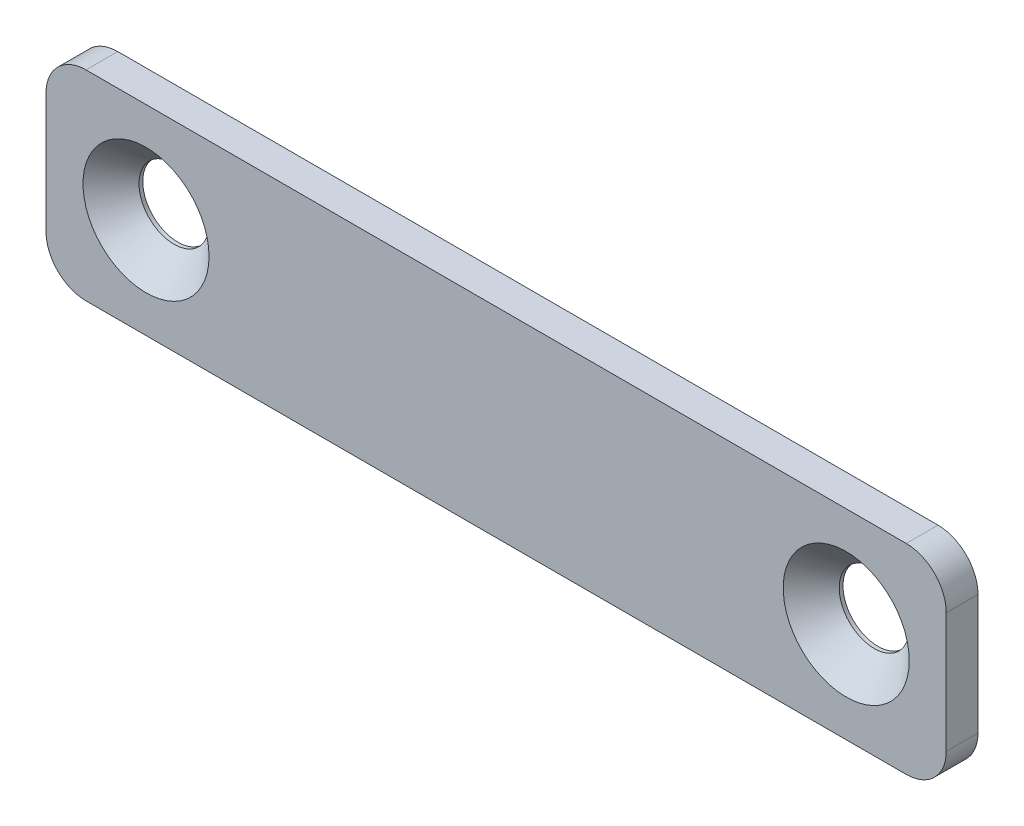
from build123d import *

# Parameters (mm, degrees)
SKETCH1_W                                      = 45
SKETCH1_H                                      = 10
SKETCH1_R                                      = 1.75
BOSS_EXTRUDE1_DEPTH                            = 1.5875
FILLET1_R                                      = 2
CSK_FOR_M3_FLAT_HEAD_MACHINE_SCREW1_AT_2_COUNT = 2
CSK_FOR_M3_FLAT_HEAD_MACHINE_SCREW1_AT_2_PITCH = 35


with BuildPart() as part:
    # Sketch1 → Boss-Extrude1 (new body)
    with BuildSketch(Plane.XY):
        Rectangle(SKETCH1_W, SKETCH1_H)
        with Locations((17.5, 0)):
            Circle(SKETCH1_R, mode=Mode.SUBTRACT)
        with Locations(Location((-17.5, 0, 0), (0, 0, 180))):
            Circle(SKETCH1_R, mode=Mode.SUBTRACT)
    extrude(amount=BOSS_EXTRUDE1_DEPTH)

    # Fillet1
    fillet1_edges = [part.edges().sort_by_distance(p)[0] for p in [
        (22.5, -5, 0.79375),
        (-22.5, -5, 0.79375),
        (-22.5, 5, 0.79375),
        (22.5, 5, 0.79375),
    ]]
    fillet(fillet1_edges, radius=FILLET1_R)

    # Sketch2 → CSK for M3 Flat Head Machine Screw1 (revolve, cut)
    with BuildSketch(Plane(origin=(-17.5, 0, 1.5875), x_dir=(0, -1, 0), z_dir=(1, 0, 0))):
        Polygon((0, 0), (0, 1.5875), (1.7, 1.5875), (1.7, 1.45), (3.15, 0), align=None)
    csk_for_m3_flat_head_machine_screw1 = revolve(axis=Axis((-17.5, 0, 7.9375), (0, 0, -1)), mode=Mode.SUBTRACT)

    # CSK for M3 Flat Head Machine Screw1 at 2: CSK for M3 Flat Head Machine Screw1 ×2
    with Locations(*[(i * CSK_FOR_M3_FLAT_HEAD_MACHINE_SCREW1_AT_2_PITCH, 0, 0) for i in range(1, CSK_FOR_M3_FLAT_HEAD_MACHINE_SCREW1_AT_2_COUNT)]):
        add(csk_for_m3_flat_head_machine_screw1, mode=Mode.SUBTRACT)


solid = part.part
